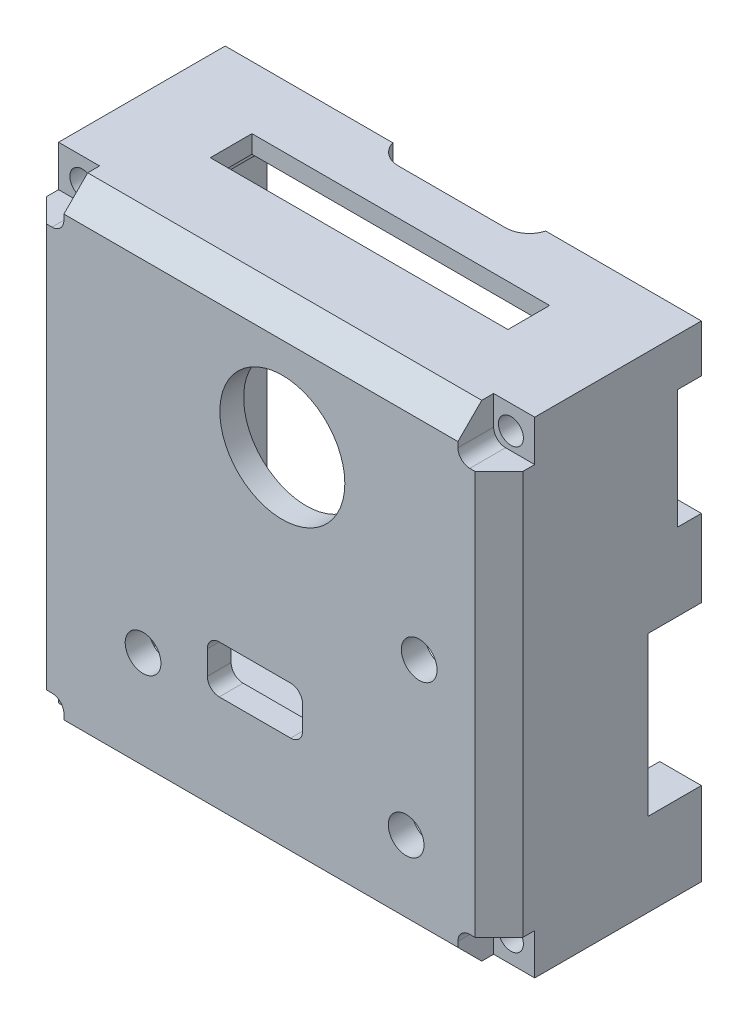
from build123d import *

# Parameters (mm, degrees)
SKETCH1_W           = 40
SKETCH1_H           = 40.8
BOSS_EXTRUDE1_DEPTH = 17
SKETCH2_W           = 33
SKETCH2_H           = 33.6
CUT_EXTRUDE1_DEPTH  = 15
SKETCH4_W           = 4
SKETCH4_H           = 10
SKETCH4_W_2         = 9
SKETCH4_H_2         = 13.3
CUT_EXTRUDE3_DEPTH  = 7
SKETCH5_R           = 1.05
CUT_EXTRUDE4_DEPTH  = 20
SKETCH6_W           = 3.45
SKETCH6_H           = 3.45
CUT_EXTRUDE6_DEPTH  = 3
SKETCH7_R           = 1.5
SKETCH7_R_2         = 5.25
SKETCH7_W           = 8
SKETCH7_H           = 4
CUT_EXTRUDE7_DEPTH  = 3
CHAMFER1_SIZE       = 2
FILLET1_R           = 1
FILLET2_R           = 1
CUT_EXTRUDE8_DEPTH  = 10
SKETCH9_W           = 29.756310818
SKETCH9_H           = 4.2
CUT_EXTRUDE9_DEPTH  = 15
SKETCH10_W          = 25
SKETCH10_H          = 3.5
CUT_EXTRUDE10_DEPTH = 10


with BuildPart() as part:
    # Sketch1 → Boss-Extrude1 (new body)
    with BuildSketch(Plane.XY):
        Rectangle(SKETCH1_W, SKETCH1_H)
    extrude(amount=BOSS_EXTRUDE1_DEPTH)

    # Sketch2 → Cut-Extrude1 (cut)
    with BuildSketch(Plane(origin=(0, 0, 0), x_dir=(-1, 0, 0), z_dir=(0, 0, -1))):
        Rectangle(SKETCH2_W, SKETCH2_H)
    extrude(amount=-CUT_EXTRUDE1_DEPTH, mode=Mode.SUBTRACT)

    # Sketch4 → Cut-Extrude3 (cut)
    with BuildSketch(Plane(origin=(20, 0, 0), x_dir=(0, 0, -1), z_dir=(1, 0, 0))):
        with Locations((0, 11.4)):
            Rectangle(SKETCH4_W, SKETCH4_H)
        with Locations((0, -6.75)):
            Rectangle(SKETCH4_W_2, SKETCH4_H_2)
    extrude(amount=-CUT_EXTRUDE3_DEPTH, mode=Mode.SUBTRACT)

    # Sketch5 → Cut-Extrude4 (cut)
    with BuildSketch(Plane.XY.offset(17)):
        with Locations((-18, 18.4)):
            Circle(SKETCH5_R)
        with Locations((18, 18.4)):
            Circle(SKETCH5_R)
        with Locations((18, -18.4)):
            Circle(SKETCH5_R)
        with Locations((-18, -18.4)):
            Circle(SKETCH5_R)
    extrude(amount=-CUT_EXTRUDE4_DEPTH, mode=Mode.SUBTRACT)

    # Sketch6 → Cut-Extrude6 (cut)
    with BuildSketch(Plane.XY.offset(17)):
        with Locations((18.275, 18.675)):
            Rectangle(SKETCH6_W, SKETCH6_H)
        with Locations((-18.275, 18.675)):
            Rectangle(SKETCH6_W, SKETCH6_H)
        with Locations((-18.275, -18.675)):
            Rectangle(SKETCH6_W, SKETCH6_H)
        with Locations((18.275, -18.675)):
            Rectangle(SKETCH6_W, SKETCH6_H)
    extrude(amount=-CUT_EXTRUDE6_DEPTH, mode=Mode.SUBTRACT)

    # Sketch7 → Cut-Extrude7 (cut)
    with BuildSketch(Plane.XY.offset(17)):
        with Locations((-9.9, -10.2)):
            Circle(SKETCH7_R)
        with Locations((12.2, -12.4)):
            Circle(SKETCH7_R)
        with Locations((13.3, 0.9)):
            Circle(SKETCH7_R)
        with Locations((1.8, 10.6)):
            Circle(SKETCH7_R_2)
        with Locations((-0.5, -8.2)):
            Rectangle(SKETCH7_W, SKETCH7_H)
    extrude(amount=-CUT_EXTRUDE7_DEPTH, mode=Mode.SUBTRACT)

    # Chamfer1
    chamfer1_edges = [part.edges().sort_by_distance(p)[0] for p in [
        (20, 0, 17),
        (0, 20.4, 17),
        (-20, 0, 17),
        (0, -20.4, 17),
    ]]
    chamfer(chamfer1_edges, length=CHAMFER1_SIZE)

    # Fillet1
    fillet1_edges = [part.edges().sort_by_distance(p)[0] for p in [
        (3.5, -6.2, 16),
        (3.5, -10.2, 16),
        (-4.5, -10.2, 16),
        (-4.5, -6.2, 16),
    ]]
    fillet(fillet1_edges, radius=FILLET1_R)

    # Fillet2
    fillet2_edges = [part.edges().sort_by_distance(p)[0] for p in [
        (-16.55, -16.95, 15.5),
        (16.55, 16.95, 15.5),
        (16.55, -16.95, 15.5),
        (-16.55, 16.95, 15.5),
    ]]
    fillet(fillet2_edges, radius=FILLET2_R)

    # Sketch8 → Cut-Extrude8 (cut)
    with BuildSketch(Plane(origin=(0, 20.4, 0), x_dir=(1, 0, 0), z_dir=(0, 1, 0))):
        with BuildLine():
            Line((-4, -1.45), (5, -1.45))
            ThreePointArc((5, -1.45), (6.414213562, -0.864213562), (7, 0.55))
            Line((7, 0.55), (7, 1.05))
            ThreePointArc((7, 1.05), (6.414213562, 2.464213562), (5, 3.05))
            Line((5, 3.05), (-4, 3.05))
            ThreePointArc((-4, 3.05), (-5.414213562, 2.464213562), (-6, 1.05))
            Line((-6, 1.05), (-6, 0.55))
            ThreePointArc((-6, 0.55), (-5.414213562, -0.864213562), (-4, -1.45))
        make_face()
    extrude(amount=-CUT_EXTRUDE8_DEPTH, mode=Mode.SUBTRACT)

    # Sketch9 → Cut-Extrude9 (cut)
    with BuildSketch(Plane(origin=(0, 0, 0), x_dir=(-1, 0, 0), z_dir=(0, 0, -1))):
        with Locations((-0.5, 16.8)):
            Rectangle(SKETCH9_W, SKETCH9_H)
    extrude(amount=-CUT_EXTRUDE9_DEPTH, mode=Mode.SUBTRACT)

    # Sketch10 → Cut-Extrude10 (cut)
    with BuildSketch(Plane(origin=(0, 20.4, 0), x_dir=(1, 0, 0), z_dir=(0, 1, 0))):
        with Locations((0, -7)):
            Rectangle(SKETCH10_W, SKETCH10_H)
    extrude(amount=-CUT_EXTRUDE10_DEPTH, mode=Mode.SUBTRACT)


solid = part.part
